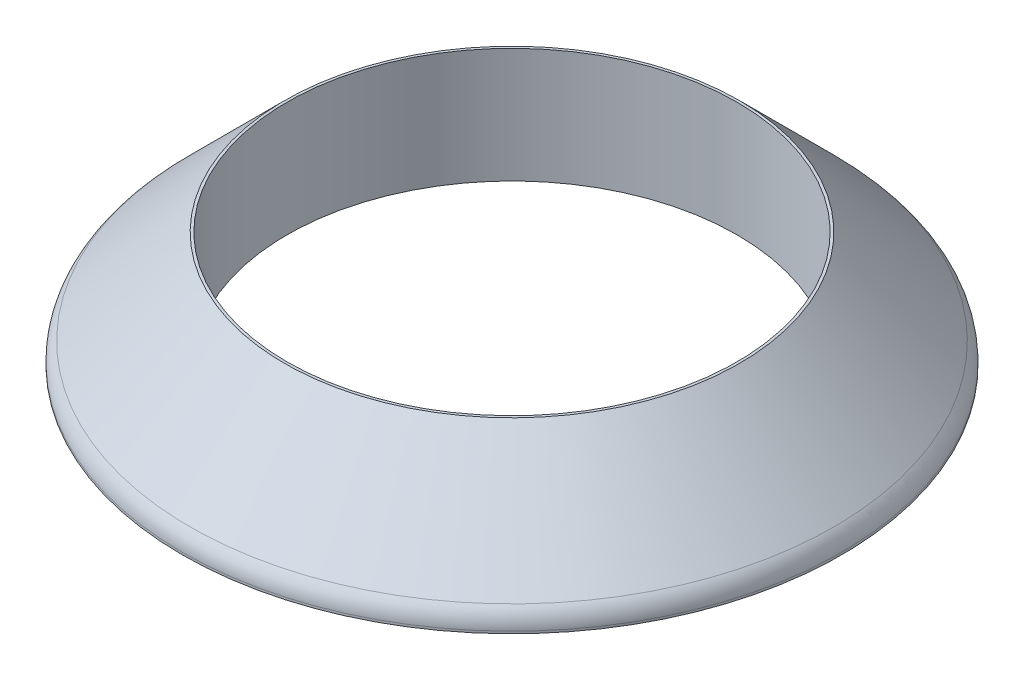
ISO-10303-21;
HEADER;
FILE_DESCRIPTION(('STEP AP214'),'2;1');
FILE_NAME('part.step','',(''),(''),'','','');
FILE_SCHEMA(('AUTOMOTIVE_DESIGN { 1 0 10303 214 1 1 1 1 }'));
ENDSEC;
DATA;
#1=APPLICATION_CONTEXT('core data for automotive mechanical design processes');
#2=APPLICATION_PROTOCOL_DEFINITION('international standard','automotive_design',2000,#1);
#3=PRODUCT_CONTEXT('',#1,'mechanical');
#4=PRODUCT('Part','Part','',(#3));
#5=PRODUCT_RELATED_PRODUCT_CATEGORY('part','',(#4));
#6=PRODUCT_DEFINITION_FORMATION('','',#4);
#7=PRODUCT_DEFINITION_CONTEXT('part definition',#1,'design');
#8=PRODUCT_DEFINITION('design','',#6,#7);
#9=PRODUCT_DEFINITION_SHAPE('','',#8);
#10=(LENGTH_UNIT() NAMED_UNIT(*) SI_UNIT(.MILLI.,.METRE.));
#11=(NAMED_UNIT(*) PLANE_ANGLE_UNIT() SI_UNIT($,.RADIAN.));
#12=(NAMED_UNIT(*) SI_UNIT($,.STERADIAN.) SOLID_ANGLE_UNIT());
#13=UNCERTAINTY_MEASURE_WITH_UNIT(LENGTH_MEASURE(1.E-05),#10,'distance_accuracy_value','');
#14=(GEOMETRIC_REPRESENTATION_CONTEXT(3) GLOBAL_UNCERTAINTY_ASSIGNED_CONTEXT((#13)) GLOBAL_UNIT_ASSIGNED_CONTEXT((#10,
#11,#12)) REPRESENTATION_CONTEXT('',''));
#15=CARTESIAN_POINT('',(0.,0.,0.));
#16=DIRECTION('',(0.,0.,1.));
#17=DIRECTION('',(1.,0.,0.));
#18=AXIS2_PLACEMENT_3D('',#15,#16,#17);
#19=CARTESIAN_POINT('',(0.,0.,0.));
#20=DIRECTION('',(0.,-1.,0.));
#21=DIRECTION('',(0.,0.,-1.));
#22=AXIS2_PLACEMENT_3D('',#19,#20,#21);
#23=CYLINDRICAL_SURFACE('',#22,161.838743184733);
#24=CARTESIAN_POINT('',(0.,0.,0.));
#25=DIRECTION('',(0.,-1.,0.));
#26=DIRECTION('',(0.,0.,-1.));
#27=AXIS2_PLACEMENT_3D('',#24,#25,#26);
#28=CIRCLE('',#27,161.838743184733);
#29=CARTESIAN_POINT('',(0.,0.,-161.838743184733));
#30=VERTEX_POINT('',#29);
#31=EDGE_CURVE('E71',#30,#30,#28,.T.);
#32=ORIENTED_EDGE('',*,*,#31,.F.);
#33=EDGE_LOOP('',(#32));
#34=FACE_BOUND('',#33,.T.);
#35=CARTESIAN_POINT('',(0.,1.08948775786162,0.));
#36=DIRECTION('',(0.,-1.,0.));
#37=DIRECTION('',(0.,0.,-1.));
#38=AXIS2_PLACEMENT_3D('',#35,#36,#37);
#39=CIRCLE('',#38,161.838743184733);
#40=CARTESIAN_POINT('',(0.,1.08948775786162,-161.838743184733));
#41=VERTEX_POINT('',#40);
#42=EDGE_CURVE('E56',#41,#41,#39,.T.);
#43=ORIENTED_EDGE('',*,*,#42,.T.);
#44=EDGE_LOOP('',(#43));
#45=FACE_BOUND('',#44,.T.);
#46=ADVANCED_FACE('F32',(#34,#45),#23,.T.);
#47=CARTESIAN_POINT('',(0.,1.08948775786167,0.));
#48=DIRECTION('',(0.,-1.,0.));
#49=DIRECTION('',(0.,0.,-1.));
#50=AXIS2_PLACEMENT_3D('',#47,#48,#49);
#51=TOROIDAL_SURFACE('',#50,149.138743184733,12.7);
#52=ORIENTED_EDGE('',*,*,#42,.F.);
#53=EDGE_LOOP('',(#52));
#54=FACE_BOUND('',#53,.T.);
#55=CARTESIAN_POINT('',(0.,10.0697438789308,0.));
#56=DIRECTION('',(0.,-1.,0.));
#57=DIRECTION('',(0.,0.,-1.));
#58=AXIS2_PLACEMENT_3D('',#55,#56,#57);
#59=CIRCLE('',#58,158.118999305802);
#60=CARTESIAN_POINT('',(0.,10.0697438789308,-158.118999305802));
#61=VERTEX_POINT('',#60);
#62=EDGE_CURVE('E59',#61,#61,#59,.T.);
#63=ORIENTED_EDGE('',*,*,#62,.T.);
#64=EDGE_LOOP('',(#63));
#65=FACE_BOUND('',#64,.T.);
#66=ADVANCED_FACE('F79',(#54,#65),#51,.T.);
#67=CARTESIAN_POINT('',(0.,56.4287431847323,0.));
#68=DIRECTION('',(0.,-1.,0.));
#69=DIRECTION('',(0.,0.,-1.));
#70=AXIS2_PLACEMENT_3D('',#67,#68,#69);
#71=CONICAL_SURFACE('',#70,111.76,0.785398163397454);
#72=ORIENTED_EDGE('',*,*,#62,.F.);
#73=EDGE_LOOP('',(#72));
#74=FACE_BOUND('',#73,.T.);
#75=CARTESIAN_POINT('',(0.,56.4287431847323,0.));
#76=DIRECTION('',(0.,-1.,0.));
#77=DIRECTION('',(0.,0.,-1.));
#78=AXIS2_PLACEMENT_3D('',#75,#76,#77);
#79=CIRCLE('',#78,111.76);
#80=CARTESIAN_POINT('',(0.,56.4287431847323,-111.76));
#81=VERTEX_POINT('',#80);
#82=EDGE_CURVE('E62',#81,#81,#79,.T.);
#83=ORIENTED_EDGE('',*,*,#82,.T.);
#84=EDGE_LOOP('',(#83));
#85=FACE_BOUND('',#84,.T.);
#86=ADVANCED_FACE('F85',(#74,#85),#71,.T.);
#87=CARTESIAN_POINT('',(-111.76,56.4287431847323,0.));
#88=DIRECTION('',(0.,-1.,0.));
#89=DIRECTION('',(0.,0.,-1.));
#90=AXIS2_PLACEMENT_3D('',#87,#88,#89);
#91=PLANE('',#90);
#92=ORIENTED_EDGE('',*,*,#82,.F.);
#93=EDGE_LOOP('',(#92));
#94=FACE_BOUND('',#93,.T.);
#95=CARTESIAN_POINT('',(0.,56.4287431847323,0.));
#96=DIRECTION('',(0.,-1.,0.));
#97=DIRECTION('',(0.,0.,-1.));
#98=AXIS2_PLACEMENT_3D('',#95,#96,#97);
#99=CIRCLE('',#98,110.49);
#100=CARTESIAN_POINT('',(0.,56.4287431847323,-110.49));
#101=VERTEX_POINT('',#100);
#102=EDGE_CURVE('E65',#101,#101,#99,.T.);
#103=ORIENTED_EDGE('',*,*,#102,.T.);
#104=EDGE_LOOP('',(#103));
#105=FACE_BOUND('',#104,.T.);
#106=ADVANCED_FACE('F91',(#94,#105),#91,.F.);
#107=CARTESIAN_POINT('',(0.,0.,0.));
#108=DIRECTION('',(0.,-1.,0.));
#109=DIRECTION('',(0.,0.,-1.));
#110=AXIS2_PLACEMENT_3D('',#107,#108,#109);
#111=CYLINDRICAL_SURFACE('',#110,110.49);
#112=ORIENTED_EDGE('',*,*,#102,.F.);
#113=EDGE_LOOP('',(#112));
#114=FACE_BOUND('',#113,.T.);
#115=CARTESIAN_POINT('',(0.,0.,0.));
#116=DIRECTION('',(0.,-1.,0.));
#117=DIRECTION('',(0.,0.,-1.));
#118=AXIS2_PLACEMENT_3D('',#115,#116,#117);
#119=CIRCLE('',#118,110.49);
#120=CARTESIAN_POINT('',(0.,0.,-110.49));
#121=VERTEX_POINT('',#120);
#122=EDGE_CURVE('E68',#121,#121,#119,.T.);
#123=ORIENTED_EDGE('',*,*,#122,.T.);
#124=EDGE_LOOP('',(#123));
#125=FACE_BOUND('',#124,.T.);
#126=ADVANCED_FACE('F97',(#114,#125),#111,.F.);
#127=CARTESIAN_POINT('',(-110.49,0.,0.));
#128=DIRECTION('',(0.,1.,0.));
#129=DIRECTION('',(0.,0.,1.));
#130=AXIS2_PLACEMENT_3D('',#127,#128,#129);
#131=PLANE('',#130);
#132=ORIENTED_EDGE('',*,*,#122,.F.);
#133=EDGE_LOOP('',(#132));
#134=FACE_BOUND('',#133,.T.);
#135=ORIENTED_EDGE('',*,*,#31,.T.);
#136=EDGE_LOOP('',(#135));
#137=FACE_BOUND('',#136,.T.);
#138=ADVANCED_FACE('F75',(#134,#137),#131,.F.);
#139=CLOSED_SHELL('',(#46,#66,#86,#106,#126,#138));
#140=CARTESIAN_POINT('',(0.,6.98499999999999,0.));
#141=DIRECTION('',(0.,-1.,0.));
#142=DIRECTION('',(0.,0.,-1.));
#143=AXIS2_PLACEMENT_3D('',#140,#141,#142);
#144=TOROIDAL_SURFACE('',#143,117.475,3.17499999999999);
#145=CARTESIAN_POINT('',(0.,6.98499999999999,0.));
#146=DIRECTION('',(0.,-1.,0.));
#147=DIRECTION('',(0.,0.,-1.));
#148=AXIS2_PLACEMENT_3D('',#145,#146,#147);
#149=CIRCLE('',#148,114.3);
#150=CARTESIAN_POINT('',(0.,6.98499999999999,-114.3));
#151=VERTEX_POINT('',#150);
#152=EDGE_CURVE('E10',#151,#151,#149,.T.);
#153=ORIENTED_EDGE('',*,*,#152,.T.);
#154=EDGE_LOOP('',(#153));
#155=FACE_BOUND('',#154,.T.);
#156=CARTESIAN_POINT('',(0.,3.80999999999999,0.));
#157=DIRECTION('',(0.,-1.,0.));
#158=DIRECTION('',(0.,0.,-1.));
#159=AXIS2_PLACEMENT_3D('',#156,#157,#158);
#160=CIRCLE('',#159,117.475);
#161=CARTESIAN_POINT('',(0.,3.80999999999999,-117.475));
#162=VERTEX_POINT('',#161);
#163=EDGE_CURVE('E53',#162,#162,#160,.T.);
#164=ORIENTED_EDGE('',*,*,#163,.F.);
#165=EDGE_LOOP('',(#164));
#166=FACE_BOUND('',#165,.T.);
#167=ADVANCED_FACE('F34',(#155,#166),#144,.F.);
#168=CARTESIAN_POINT('',(0.,0.,0.));
#169=DIRECTION('',(0.,-1.,0.));
#170=DIRECTION('',(0.,0.,-1.));
#171=AXIS2_PLACEMENT_3D('',#168,#169,#170);
#172=CYLINDRICAL_SURFACE('',#171,114.3);
#173=CARTESIAN_POINT('',(0.,48.5005895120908,0.));
#174=DIRECTION('',(0.,-1.,0.));
#175=DIRECTION('',(0.,0.,-1.));
#176=AXIS2_PLACEMENT_3D('',#173,#174,#175);
#177=CIRCLE('',#176,114.3);
#178=CARTESIAN_POINT('',(0.,48.5005895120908,-114.3));
#179=VERTEX_POINT('',#178);
#180=EDGE_CURVE('E40',#179,#179,#177,.T.);
#181=ORIENTED_EDGE('',*,*,#180,.T.);
#182=EDGE_LOOP('',(#181));
#183=FACE_BOUND('',#182,.T.);
#184=ORIENTED_EDGE('',*,*,#152,.F.);
#185=EDGE_LOOP('',(#184));
#186=FACE_BOUND('',#185,.T.);
#187=ADVANCED_FACE('F123',(#183,#186),#172,.T.);
#188=CARTESIAN_POINT('',(0.,48.5005895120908,0.));
#189=DIRECTION('',(0.,-1.,0.));
#190=DIRECTION('',(0.,0.,-1.));
#191=AXIS2_PLACEMENT_3D('',#188,#189,#190);
#192=CONICAL_SURFACE('',#191,114.3,0.785398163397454);
#193=CARTESIAN_POINT('',(0.,9.23006403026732,0.));
#194=DIRECTION('',(0.,-1.,0.));
#195=DIRECTION('',(0.,0.,-1.));
#196=AXIS2_PLACEMENT_3D('',#193,#194,#195);
#197=CIRCLE('',#196,153.570525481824);
#198=CARTESIAN_POINT('',(0.,9.23006403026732,-153.570525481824));
#199=VERTEX_POINT('',#198);
#200=EDGE_CURVE('E44',#199,#199,#197,.T.);
#201=ORIENTED_EDGE('',*,*,#200,.T.);
#202=EDGE_LOOP('',(#201));
#203=FACE_BOUND('',#202,.T.);
#204=ORIENTED_EDGE('',*,*,#180,.F.);
#205=EDGE_LOOP('',(#204));
#206=FACE_BOUND('',#205,.T.);
#207=ADVANCED_FACE('F120',(#203,#206),#192,.F.);
#208=CARTESIAN_POINT('',(0.,6.985,0.));
#209=DIRECTION('',(0.,-1.,0.));
#210=DIRECTION('',(0.,0.,-1.));
#211=AXIS2_PLACEMENT_3D('',#208,#209,#210);
#212=TOROIDAL_SURFACE('',#211,151.325461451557,3.17499999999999);
#213=CARTESIAN_POINT('',(0.,3.80999999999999,0.));
#214=DIRECTION('',(0.,-1.,0.));
#215=DIRECTION('',(0.,0.,-1.));
#216=AXIS2_PLACEMENT_3D('',#213,#214,#215);
#217=CIRCLE('',#216,151.325461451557);
#218=CARTESIAN_POINT('',(0.,3.80999999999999,-151.325461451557));
#219=VERTEX_POINT('',#218);
#220=EDGE_CURVE('E48',#219,#219,#217,.T.);
#221=ORIENTED_EDGE('',*,*,#220,.T.);
#222=EDGE_LOOP('',(#221));
#223=FACE_BOUND('',#222,.T.);
#224=ORIENTED_EDGE('',*,*,#200,.F.);
#225=EDGE_LOOP('',(#224));
#226=FACE_BOUND('',#225,.T.);
#227=ADVANCED_FACE('F115',(#223,#226),#212,.F.);
#228=CARTESIAN_POINT('',(-151.325461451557,3.80999999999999,0.));
#229=DIRECTION('',(0.,1.,0.));
#230=DIRECTION('',(0.,0.,1.));
#231=AXIS2_PLACEMENT_3D('',#228,#229,#230);
#232=PLANE('',#231);
#233=ORIENTED_EDGE('',*,*,#163,.T.);
#234=EDGE_LOOP('',(#233));
#235=FACE_BOUND('',#234,.T.);
#236=ORIENTED_EDGE('',*,*,#220,.F.);
#237=EDGE_LOOP('',(#236));
#238=FACE_BOUND('',#237,.T.);
#239=ADVANCED_FACE('F112',(#235,#238),#232,.T.);
#240=CLOSED_SHELL('',(#167,#187,#207,#227,#239));
#241=ORIENTED_CLOSED_SHELL('',*,#240,.T.);
#242=BREP_WITH_VOIDS('B2',#139,(#241));
#243=ADVANCED_BREP_SHAPE_REPRESENTATION('',(#18,#242),#14);
#244=SHAPE_DEFINITION_REPRESENTATION(#9,#243);
ENDSEC;
END-ISO-10303-21;
